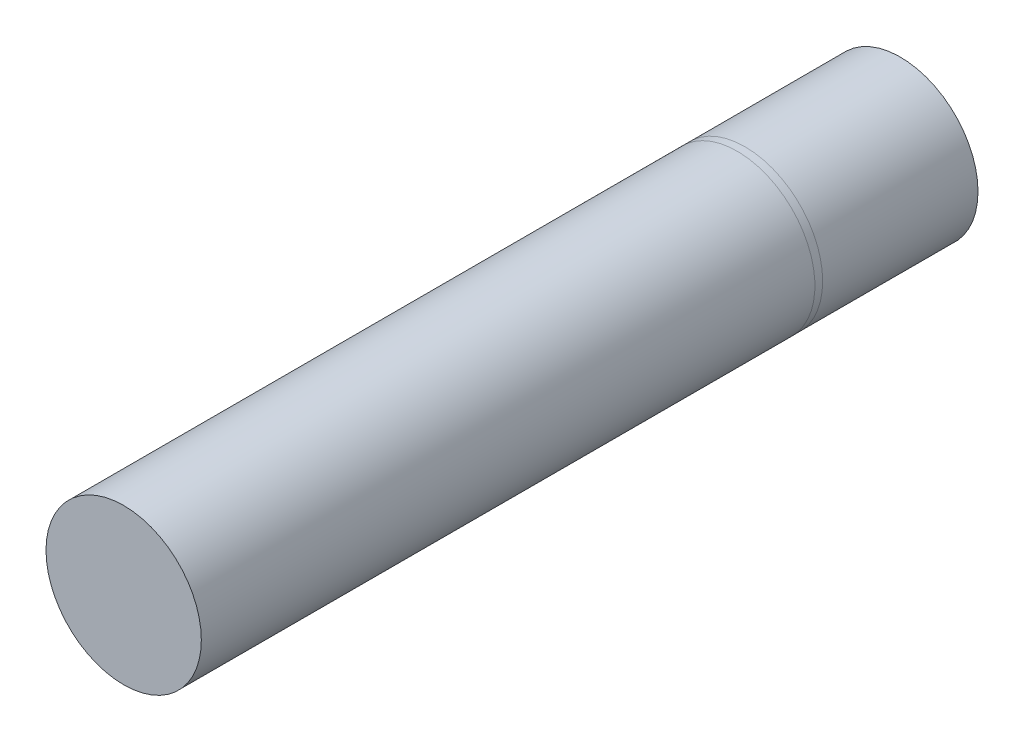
from build123d import *

# Parameters (mm, degrees)
SKIZZE1_R               = 10
LINEAR_AUSTRAGEN1_DEPTH = 100


with BuildPart() as part:
    # Skizze1 → Linear austragen1 (new body)
    with BuildSketch(Plane.XY):
        Circle(SKIZZE1_R)
    extrude(amount=LINEAR_AUSTRAGEN1_DEPTH)


solid = part.part
